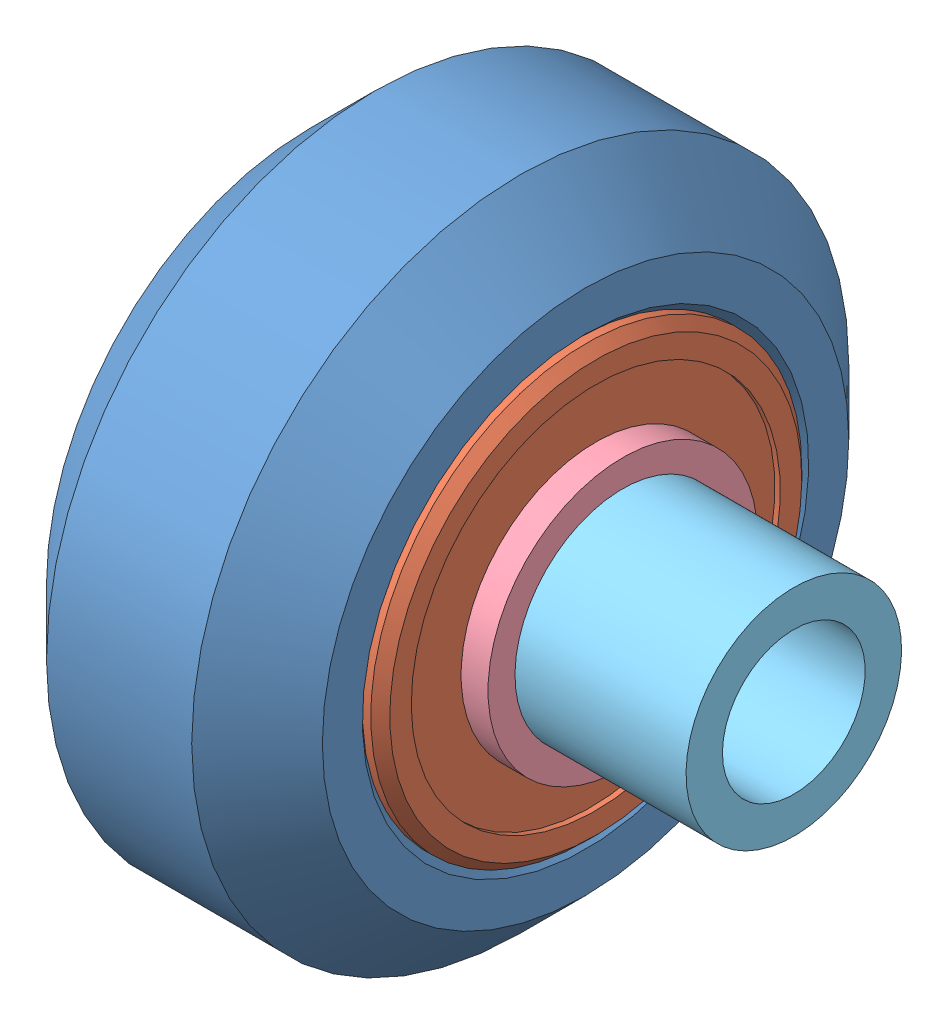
SolidWorks assembly solid v wheel assy, simple.sldasm, configuration Default (file format 4400). Lengths in mm.
Overall size (18.35 24.39 24.39).
6 component instances, 5 part files, 10 mates.
Components (placement in the parent):
- Solid V Wheel-1: Solid V Wheel.SLDPRT [Default] at (-14.5507 3.5936 5.2367) size (10.24 24.39 24.39)
- 625 2RS Bearing-2: 625 2RS Bearing.SLDPRT [Default] at (-11.5507 3.5936 5.2367) x (0 0.881845 0.471538) z (0 -0.471538 0.881845) size (16 5 16)
- Micro V Precision Shim-1: Micro V Precision Shim.SLDPRT [Default] at (-14.0507 3.5936 5.2367) x (0 0 1) z (-1 0 0) size (8 8 1)
- 625 2RS Bearing-4: 625 2RS Bearing.SLDPRT [Default] at (-17.5507 3.5936 5.2367) x (0 -1 0) z (0 0 1) size (16 5 16)
- 5mm Precision Washer-1: 5mm Precision Washer.SLDPRT [Default] at (-8.0507 3.5936 5.2367) x (0 0 1) z (-1 0 0) size (10 10 1)
- Normal M5 Wheel Spacer-1: Normal M5 Wheel Spacer.SLDPRT [Default] at (-1.7007 3.5936 5.2367) x (0 -0.830925 0.556385) z (-1 0 0) size (8 8 6.35)
Mates (geometry in assembly coordinates):
- Coincident1: coincident anti-aligned: plane of Solid V Wheel-1 through (-14.0507 11.0596 5.2367) normal (1 0 0); plane of 625 2RS Bearing-2 through (-14.0507 -2.7982 1.8189) normal (-1 0 0)
- Concentric1: concentric aligned: cylinder of Solid V Wheel-1 through (-11.8907 3.5936 5.2367) axis (-1 0 0) radius 7.987; cylinder of 625 2RS Bearing-2 through (-12.624 3.5936 5.2367) axis (-1 0 0) radius 8
- Concentric31: concentric anti-aligned: cylinder of 625 2RS Bearing-2 through (-13.9507 3.5936 5.2367) axis (1 0 0) radius 6.85; cylinder of Micro V Precision Shim-1 through (-14.0507 3.5936 5.2367) axis (-1 0 0) radius 4
- Coincident31: coincident anti-aligned: plane of 625 2RS Bearing-2 through (-14.0507 -2.7982 1.8189) normal (-1 0 0); plane of Micro V Precision Shim-1 through (-14.0507 3.5936 5.2367) normal (1 0 0)
- Concentric41: concentric anti-aligned: cylinder of Micro V Precision Shim-1 through (-14.0507 3.5936 5.2367) axis (-1 0 0) radius 4; cone of 625 2RS Bearing-4 through (-15.2275 3.5936 5.2367) axis (1 0 0)
- Coincident41: coincident anti-aligned: plane of Micro V Precision Shim-1 through (-15.0507 3.5936 5.2367) normal (-1 0 0); plane of 625 2RS Bearing-4 through (-15.0507 10.8419 5.2367) normal (1 0 0)
- Concentric51: concentric aligned: cone of 625 2RS Bearing-2 through (-9.3007 3.5936 5.2367) axis (-1 0 0); cylinder of 5mm Precision Washer-1 through (-8.0507 3.5936 5.2367) axis (-1 0 0) radius 2.5
- Coincident51: coincident anti-aligned: plane of 625 2RS Bearing-2 through (-9.0507 0.3749 3.5156) normal (1 0 0); plane of 5mm Precision Washer-1 through (-9.0507 3.5936 5.2367) normal (-1 0 0)
- Concentric61: concentric aligned: cylinder of 5mm Precision Washer-1 through (-8.0507 3.5936 5.2367) axis (-1 0 0) radius 2.5; cylinder of Normal M5 Wheel Spacer-1 through (-1.7007 3.5936 5.2367) axis (-1 0 0) radius 2.65
- Coincident61: coincident anti-aligned: plane of 5mm Precision Washer-1 through (-8.0507 3.5936 5.2367) normal (1 0 0); plane of Normal M5 Wheel Spacer-1 through (-8.0507 3.5936 5.2367) normal (-1 0 0)
